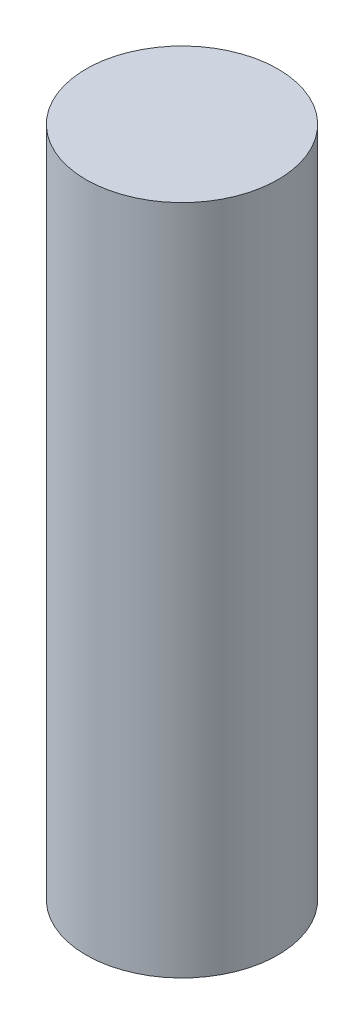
from build123d import *

# Parameters (mm, degrees)
SKETCH1_R           = 8
BOSS_EXTRUDE1_DEPTH = 56


with BuildPart() as part:
    # Sketch1 → Boss-Extrude1 (new body)
    with BuildSketch(Plane(origin=(0, 0, 0), x_dir=(1, 0, 0), z_dir=(0, 1, 0))):
        with Locations(Location((0, 0, 0), (0, 0, 270))):
            Circle(SKETCH1_R)
    extrude(amount=BOSS_EXTRUDE1_DEPTH)


solid = part.part
